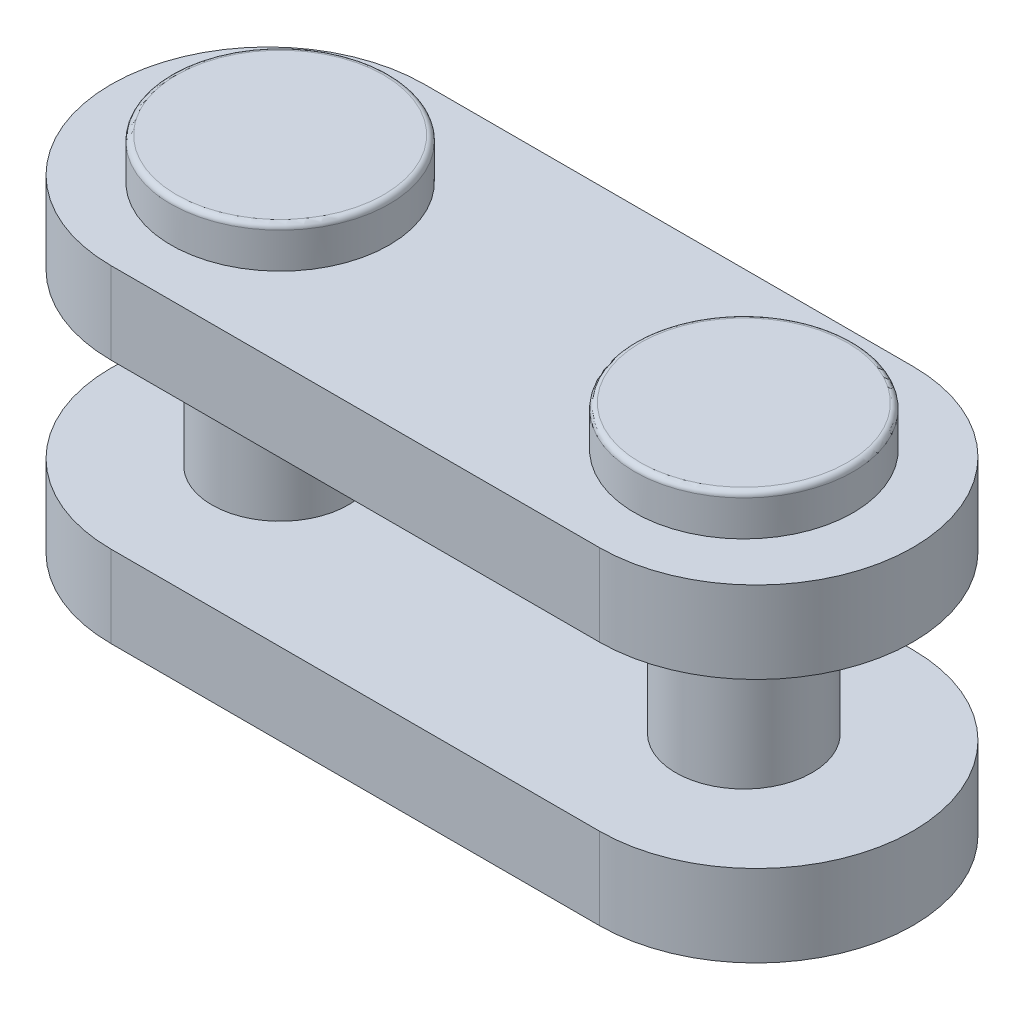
ISO-10303-21;
HEADER;
FILE_DESCRIPTION(('STEP AP214'),'2;1');
FILE_NAME('part.step','',(''),(''),'','','');
FILE_SCHEMA(('AUTOMOTIVE_DESIGN { 1 0 10303 214 1 1 1 1 }'));
ENDSEC;
DATA;
#1=APPLICATION_CONTEXT('core data for automotive mechanical design processes');
#2=APPLICATION_PROTOCOL_DEFINITION('international standard','automotive_design',2000,#1);
#3=PRODUCT_CONTEXT('',#1,'mechanical');
#4=PRODUCT('Part','Part','',(#3));
#5=PRODUCT_RELATED_PRODUCT_CATEGORY('part','',(#4));
#6=PRODUCT_DEFINITION_FORMATION('','',#4);
#7=PRODUCT_DEFINITION_CONTEXT('part definition',#1,'design');
#8=PRODUCT_DEFINITION('design','',#6,#7);
#9=PRODUCT_DEFINITION_SHAPE('','',#8);
#10=(LENGTH_UNIT() NAMED_UNIT(*) SI_UNIT(.MILLI.,.METRE.));
#11=(NAMED_UNIT(*) PLANE_ANGLE_UNIT() SI_UNIT($,.RADIAN.));
#12=(NAMED_UNIT(*) SI_UNIT($,.STERADIAN.) SOLID_ANGLE_UNIT());
#13=UNCERTAINTY_MEASURE_WITH_UNIT(LENGTH_MEASURE(1.E-05),#10,'distance_accuracy_value','');
#14=(GEOMETRIC_REPRESENTATION_CONTEXT(3) GLOBAL_UNCERTAINTY_ASSIGNED_CONTEXT((#13)) GLOBAL_UNIT_ASSIGNED_CONTEXT((#10,
#11,#12)) REPRESENTATION_CONTEXT('',''));
#15=CARTESIAN_POINT('',(0.,0.,0.));
#16=DIRECTION('',(0.,0.,1.));
#17=DIRECTION('',(1.,0.,0.));
#18=AXIS2_PLACEMENT_3D('',#15,#16,#17);
#19=CARTESIAN_POINT('',(0.,6.,0.));
#20=DIRECTION('',(0.,-1.,0.));
#21=DIRECTION('',(0.16756277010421,0.,-0.985861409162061));
#22=AXIS2_PLACEMENT_3D('',#19,#20,#21);
#23=CYLINDRICAL_SURFACE('',#22,2.5);
#24=CARTESIAN_POINT('',(0.,-3.,0.));
#25=DIRECTION('',(0.,1.,0.));
#26=DIRECTION('',(-0.833452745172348,0.,0.552590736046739));
#27=AXIS2_PLACEMENT_3D('',#24,#25,#26);
#28=CIRCLE('',#27,2.5);
#29=CARTESIAN_POINT('',(-2.08363186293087,-3.,1.38147684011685));
#30=VERTEX_POINT('',#29);
#31=EDGE_CURVE('E516',#30,#30,#28,.F.);
#32=ORIENTED_EDGE('',*,*,#31,.F.);
#33=EDGE_LOOP('',(#32));
#34=FACE_BOUND('',#33,.T.);
#35=CARTESIAN_POINT('',(0.,3.,0.));
#36=DIRECTION('',(0.,1.,0.));
#37=DIRECTION('',(-0.833452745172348,0.,0.552590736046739));
#38=AXIS2_PLACEMENT_3D('',#35,#36,#37);
#39=CIRCLE('',#38,2.5);
#40=CARTESIAN_POINT('',(-2.08363186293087,3.,1.38147684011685));
#41=VERTEX_POINT('',#40);
#42=EDGE_CURVE('E141',#41,#41,#39,.F.);
#43=ORIENTED_EDGE('',*,*,#42,.T.);
#44=EDGE_LOOP('',(#43));
#45=FACE_BOUND('',#44,.T.);
#46=ADVANCED_FACE('F14',(#34,#45),#23,.T.);
#47=CARTESIAN_POINT('',(0.,-7.3,0.));
#48=DIRECTION('',(0.,1.,0.));
#49=DIRECTION('',(-0.16756277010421,0.,0.985861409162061));
#50=AXIS2_PLACEMENT_3D('',#47,#48,#49);
#51=TOROIDAL_SURFACE('',#50,3.8,0.2);
#52=CARTESIAN_POINT('',(0.,-7.3,0.));
#53=DIRECTION('',(0.,1.,0.));
#54=DIRECTION('',(-0.16756277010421,0.,0.985861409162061));
#55=AXIS2_PLACEMENT_3D('',#52,#53,#54);
#56=CIRCLE('',#55,4.);
#57=CARTESIAN_POINT('',(-0.670251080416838,-7.3,3.94344563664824));
#58=VERTEX_POINT('',#57);
#59=EDGE_CURVE('E493',#58,#58,#56,.T.);
#60=ORIENTED_EDGE('',*,*,#59,.F.);
#61=EDGE_LOOP('',(#60));
#62=FACE_BOUND('',#61,.T.);
#63=CARTESIAN_POINT('',(0.,-7.5,0.));
#64=DIRECTION('',(0.,-1.,0.));
#65=DIRECTION('',(-0.16756277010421,0.,0.985861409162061));
#66=AXIS2_PLACEMENT_3D('',#63,#64,#65);
#67=CIRCLE('',#66,3.8);
#68=CARTESIAN_POINT('',(-0.636738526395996,-7.5,3.74627335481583));
#69=VERTEX_POINT('',#68);
#70=EDGE_CURVE('E494',#69,#69,#67,.T.);
#71=ORIENTED_EDGE('',*,*,#70,.F.);
#72=EDGE_LOOP('',(#71));
#73=FACE_BOUND('',#72,.T.);
#74=ADVANCED_FACE('F465',(#62,#73),#51,.T.);
#75=CARTESIAN_POINT('',(0.,-6.,0.));
#76=DIRECTION('',(0.,-1.,0.));
#77=DIRECTION('',(0.16756277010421,0.,-0.985861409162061));
#78=AXIS2_PLACEMENT_3D('',#75,#76,#77);
#79=CYLINDRICAL_SURFACE('',#78,4.);
#80=ORIENTED_EDGE('',*,*,#59,.T.);
#81=EDGE_LOOP('',(#80));
#82=FACE_BOUND('',#81,.T.);
#83=CARTESIAN_POINT('',(0.,-6.,0.));
#84=DIRECTION('',(0.,1.,0.));
#85=DIRECTION('',(-0.16756277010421,0.,0.985861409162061));
#86=AXIS2_PLACEMENT_3D('',#83,#84,#85);
#87=CIRCLE('',#86,4.);
#88=CARTESIAN_POINT('',(-0.670251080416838,-6.,3.94344563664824));
#89=VERTEX_POINT('',#88);
#90=EDGE_CURVE('E488',#89,#89,#87,.T.);
#91=ORIENTED_EDGE('',*,*,#90,.F.);
#92=EDGE_LOOP('',(#91));
#93=FACE_BOUND('',#92,.T.);
#94=ADVANCED_FACE('F171',(#82,#93),#79,.T.);
#95=CARTESIAN_POINT('',(0.,-7.5,0.));
#96=DIRECTION('',(0.,1.,0.));
#97=DIRECTION('',(-0.16756277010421,0.,0.985861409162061));
#98=AXIS2_PLACEMENT_3D('',#95,#96,#97);
#99=PLANE('',#98);
#100=ORIENTED_EDGE('',*,*,#70,.T.);
#101=EDGE_LOOP('',(#100));
#102=FACE_BOUND('',#101,.T.);
#103=ADVANCED_FACE('F161',(#102),#99,.F.);
#104=CARTESIAN_POINT('',(16.9999999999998,-7.5,-5.13478148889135E-13));
#105=DIRECTION('',(0.,1.,0.));
#106=DIRECTION('',(-0.0702895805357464,0.,-0.99752662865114));
#107=AXIS2_PLACEMENT_3D('',#104,#105,#106);
#108=PLANE('',#107);
#109=CARTESIAN_POINT('',(16.9999999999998,-7.5,-5.13478148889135E-13));
#110=DIRECTION('',(0.,-1.,0.));
#111=DIRECTION('',(-0.0702895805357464,0.,-0.99752662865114));
#112=AXIS2_PLACEMENT_3D('',#109,#110,#111);
#113=CIRCLE('',#112,3.8);
#114=CARTESIAN_POINT('',(16.7328995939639,-7.5,-3.79060118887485));
#115=VERTEX_POINT('',#114);
#116=EDGE_CURVE('E274',#115,#115,#113,.T.);
#117=ORIENTED_EDGE('',*,*,#116,.T.);
#118=EDGE_LOOP('',(#117));
#119=FACE_BOUND('',#118,.T.);
#120=ADVANCED_FACE('F158',(#119),#108,.F.);
#121=CARTESIAN_POINT('',(16.9999999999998,-7.3,-5.13478148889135E-13));
#122=DIRECTION('',(0.,1.,0.));
#123=DIRECTION('',(-0.0702895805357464,0.,-0.99752662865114));
#124=AXIS2_PLACEMENT_3D('',#121,#122,#123);
#125=TOROIDAL_SURFACE('',#124,3.8,0.2);
#126=CARTESIAN_POINT('',(16.9999999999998,-7.3,-5.13478148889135E-13));
#127=DIRECTION('',(0.,1.,0.));
#128=DIRECTION('',(-0.0702895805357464,0.,-0.99752662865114));
#129=AXIS2_PLACEMENT_3D('',#126,#127,#128);
#130=CIRCLE('',#129,4.);
#131=CARTESIAN_POINT('',(16.7188416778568,-7.3,-3.99010651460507));
#132=VERTEX_POINT('',#131);
#133=EDGE_CURVE('E383',#132,#132,#130,.T.);
#134=ORIENTED_EDGE('',*,*,#133,.F.);
#135=EDGE_LOOP('',(#134));
#136=FACE_BOUND('',#135,.T.);
#137=ORIENTED_EDGE('',*,*,#116,.F.);
#138=EDGE_LOOP('',(#137));
#139=FACE_BOUND('',#138,.T.);
#140=ADVANCED_FACE('F160',(#136,#139),#125,.T.);
#141=CARTESIAN_POINT('',(16.9999999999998,6.,-5.13478148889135E-13));
#142=DIRECTION('',(0.,-1.,0.));
#143=DIRECTION('',(0.0702895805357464,0.,0.99752662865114));
#144=AXIS2_PLACEMENT_3D('',#141,#142,#143);
#145=CYLINDRICAL_SURFACE('',#144,2.5);
#146=CARTESIAN_POINT('',(16.9999999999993,-3.,-2.32886626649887E-13));
#147=DIRECTION('',(0.,1.,0.));
#148=DIRECTION('',(1.,0.,0.));
#149=AXIS2_PLACEMENT_3D('',#146,#147,#148);
#150=CIRCLE('',#149,2.5);
#151=CARTESIAN_POINT('',(19.4999999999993,-3.,-2.36078517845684E-13));
#152=VERTEX_POINT('',#151);
#153=EDGE_CURVE('E256',#152,#152,#150,.T.);
#154=ORIENTED_EDGE('',*,*,#153,.T.);
#155=EDGE_LOOP('',(#154));
#156=FACE_BOUND('',#155,.T.);
#157=CARTESIAN_POINT('',(16.9999999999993,3.,-2.32886626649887E-13));
#158=DIRECTION('',(0.,1.,0.));
#159=DIRECTION('',(1.,0.,0.));
#160=AXIS2_PLACEMENT_3D('',#157,#158,#159);
#161=CIRCLE('',#160,2.5);
#162=CARTESIAN_POINT('',(19.4999999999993,3.,-2.3260907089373E-13));
#163=VERTEX_POINT('',#162);
#164=EDGE_CURVE('E293',#163,#163,#161,.F.);
#165=ORIENTED_EDGE('',*,*,#164,.T.);
#166=EDGE_LOOP('',(#165));
#167=FACE_BOUND('',#166,.T.);
#168=ADVANCED_FACE('F168',(#156,#167),#145,.T.);
#169=CARTESIAN_POINT('',(-0.450000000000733,-3.,-5.75000000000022));
#170=DIRECTION('',(0.,0.,1.));
#171=DIRECTION('',(-1.,0.,0.));
#172=AXIS2_PLACEMENT_3D('',#169,#170,#171);
#173=PLANE('',#172);
#174=DIRECTION('',(-1.,0.,0.));
#175=VECTOR('',#174,1.);
#176=CARTESIAN_POINT('',(-0.450000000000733,-6.,-5.75000000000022));
#177=LINE('',#176,#175);
#178=CARTESIAN_POINT('',(17.4499999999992,-6.,-5.75000000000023));
#179=VERTEX_POINT('',#178);
#180=CARTESIAN_POINT('',(-0.450000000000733,-6.,-5.75000000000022));
#181=VERTEX_POINT('',#180);
#182=EDGE_CURVE('E262',#179,#181,#177,.T.);
#183=ORIENTED_EDGE('',*,*,#182,.T.);
#184=DIRECTION('',(0.,-1.,0.));
#185=VECTOR('',#184,1.);
#186=CARTESIAN_POINT('',(-0.450000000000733,-3.,-5.75000000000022));
#187=LINE('',#186,#185);
#188=CARTESIAN_POINT('',(-0.450000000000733,-3.,-5.75000000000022));
#189=VERTEX_POINT('',#188);
#190=EDGE_CURVE('E261',#189,#181,#187,.T.);
#191=ORIENTED_EDGE('',*,*,#190,.F.);
#192=DIRECTION('',(-1.,0.,0.));
#193=VECTOR('',#192,1.);
#194=CARTESIAN_POINT('',(-0.450000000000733,-3.,-5.75000000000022));
#195=LINE('',#194,#193);
#196=CARTESIAN_POINT('',(17.4499999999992,-3.,-5.75000000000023));
#197=VERTEX_POINT('',#196);
#198=EDGE_CURVE('E240',#197,#189,#195,.T.);
#199=ORIENTED_EDGE('',*,*,#198,.F.);
#200=DIRECTION('',(0.,-1.,0.));
#201=VECTOR('',#200,1.);
#202=CARTESIAN_POINT('',(17.4499999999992,-3.,-5.75000000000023));
#203=LINE('',#202,#201);
#204=EDGE_CURVE('E266',#197,#179,#203,.T.);
#205=ORIENTED_EDGE('',*,*,#204,.T.);
#206=EDGE_LOOP('',(#183,#191,#199,#205));
#207=FACE_BOUND('',#206,.T.);
#208=ADVANCED_FACE('F186',(#207),#173,.F.);
#209=CARTESIAN_POINT('',(17.4499999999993,-3.,-2.33320307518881E-13));
#210=DIRECTION('',(0.,-1.,0.));
#211=DIRECTION('',(-1.,0.,0.));
#212=AXIS2_PLACEMENT_3D('',#209,#210,#211);
#213=CYLINDRICAL_SURFACE('',#212,5.75);
#214=CARTESIAN_POINT('',(17.4499999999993,-6.,-2.33320307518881E-13));
#215=DIRECTION('',(0.,1.,0.));
#216=DIRECTION('',(1.,0.,0.));
#217=AXIS2_PLACEMENT_3D('',#214,#215,#216);
#218=CIRCLE('',#217,5.75);
#219=CARTESIAN_POINT('',(17.4499999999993,-6.,5.74999999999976));
#220=VERTEX_POINT('',#219);
#221=EDGE_CURVE('E278',#220,#179,#218,.T.);
#222=ORIENTED_EDGE('',*,*,#221,.T.);
#223=ORIENTED_EDGE('',*,*,#204,.F.);
#224=CARTESIAN_POINT('',(17.4499999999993,-3.,-2.33320307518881E-13));
#225=DIRECTION('',(0.,1.,0.));
#226=DIRECTION('',(1.,0.,0.));
#227=AXIS2_PLACEMENT_3D('',#224,#225,#226);
#228=CIRCLE('',#227,5.75);
#229=CARTESIAN_POINT('',(17.4499999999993,-3.,5.74999999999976));
#230=VERTEX_POINT('',#229);
#231=EDGE_CURVE('E245',#230,#197,#228,.T.);
#232=ORIENTED_EDGE('',*,*,#231,.F.);
#233=DIRECTION('',(0.,-1.,0.));
#234=VECTOR('',#233,1.);
#235=CARTESIAN_POINT('',(17.4499999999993,-3.,5.74999999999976));
#236=LINE('',#235,#234);
#237=EDGE_CURVE('E265',#230,#220,#236,.T.);
#238=ORIENTED_EDGE('',*,*,#237,.T.);
#239=EDGE_LOOP('',(#222,#223,#232,#238));
#240=FACE_BOUND('',#239,.T.);
#241=ADVANCED_FACE('F197',(#240),#213,.T.);
#242=CARTESIAN_POINT('',(-0.450000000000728,-3.,5.7499999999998));
#243=DIRECTION('',(0.,0.,-1.));
#244=DIRECTION('',(1.,0.,0.));
#245=AXIS2_PLACEMENT_3D('',#242,#243,#244);
#246=PLANE('',#245);
#247=DIRECTION('',(1.,0.,0.));
#248=VECTOR('',#247,1.);
#249=CARTESIAN_POINT('',(-0.450000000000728,-6.,5.7499999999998));
#250=LINE('',#249,#248);
#251=CARTESIAN_POINT('',(-0.450000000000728,-6.,5.7499999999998));
#252=VERTEX_POINT('',#251);
#253=EDGE_CURVE('E258',#252,#220,#250,.T.);
#254=ORIENTED_EDGE('',*,*,#253,.T.);
#255=ORIENTED_EDGE('',*,*,#237,.F.);
#256=DIRECTION('',(1.,0.,0.));
#257=VECTOR('',#256,1.);
#258=CARTESIAN_POINT('',(-0.450000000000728,-3.,5.7499999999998));
#259=LINE('',#258,#257);
#260=CARTESIAN_POINT('',(-0.450000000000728,-3.,5.7499999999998));
#261=VERTEX_POINT('',#260);
#262=EDGE_CURVE('E252',#261,#230,#259,.T.);
#263=ORIENTED_EDGE('',*,*,#262,.F.);
#264=DIRECTION('',(0.,-1.,0.));
#265=VECTOR('',#264,1.);
#266=CARTESIAN_POINT('',(-0.450000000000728,-3.,5.7499999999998));
#267=LINE('',#266,#265);
#268=EDGE_CURVE('E37',#261,#252,#267,.T.);
#269=ORIENTED_EDGE('',*,*,#268,.T.);
#270=EDGE_LOOP('',(#254,#255,#263,#269));
#271=FACE_BOUND('',#270,.T.);
#272=ADVANCED_FACE('F194',(#271),#246,.F.);
#273=CARTESIAN_POINT('',(-0.450000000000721,-3.,-2.14238349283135E-13));
#274=DIRECTION('',(0.,-1.,0.));
#275=DIRECTION('',(-1.,0.,0.));
#276=AXIS2_PLACEMENT_3D('',#273,#274,#275);
#277=CYLINDRICAL_SURFACE('',#276,5.75);
#278=ORIENTED_EDGE('',*,*,#268,.F.);
#279=CARTESIAN_POINT('',(-0.450000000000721,-3.,-2.14238349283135E-13));
#280=DIRECTION('',(0.,1.,0.));
#281=DIRECTION('',(1.,0.,0.));
#282=AXIS2_PLACEMENT_3D('',#279,#280,#281);
#283=CIRCLE('',#282,5.75);
#284=EDGE_CURVE('E268',#189,#261,#283,.T.);
#285=ORIENTED_EDGE('',*,*,#284,.F.);
#286=ORIENTED_EDGE('',*,*,#190,.T.);
#287=CARTESIAN_POINT('',(-0.450000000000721,-6.,-2.14238349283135E-13));
#288=DIRECTION('',(0.,1.,0.));
#289=DIRECTION('',(1.,0.,0.));
#290=AXIS2_PLACEMENT_3D('',#287,#288,#289);
#291=CIRCLE('',#290,5.75);
#292=EDGE_CURVE('E271',#181,#252,#291,.T.);
#293=ORIENTED_EDGE('',*,*,#292,.T.);
#294=EDGE_LOOP('',(#278,#285,#286,#293));
#295=FACE_BOUND('',#294,.T.);
#296=ADVANCED_FACE('F192',(#295),#277,.T.);
#297=CARTESIAN_POINT('',(-0.450000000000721,-3.,-2.14238349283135E-13));
#298=DIRECTION('',(0.,1.,0.));
#299=DIRECTION('',(1.,0.,0.));
#300=AXIS2_PLACEMENT_3D('',#297,#298,#299);
#301=PLANE('',#300);
#302=ORIENTED_EDGE('',*,*,#284,.T.);
#303=ORIENTED_EDGE('',*,*,#262,.T.);
#304=ORIENTED_EDGE('',*,*,#231,.T.);
#305=ORIENTED_EDGE('',*,*,#198,.T.);
#306=EDGE_LOOP('',(#302,#303,#304,#305));
#307=FACE_BOUND('',#306,.T.);
#308=ORIENTED_EDGE('',*,*,#31,.T.);
#309=EDGE_LOOP('',(#308));
#310=FACE_BOUND('',#309,.T.);
#311=ORIENTED_EDGE('',*,*,#153,.F.);
#312=EDGE_LOOP('',(#311));
#313=FACE_BOUND('',#312,.T.);
#314=ADVANCED_FACE('F188',(#307,#310,#313),#301,.T.);
#315=CARTESIAN_POINT('',(-0.450000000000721,6.,-5.75000000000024));
#316=DIRECTION('',(0.,0.,1.));
#317=DIRECTION('',(-1.,0.,0.));
#318=AXIS2_PLACEMENT_3D('',#315,#316,#317);
#319=PLANE('',#318);
#320=DIRECTION('',(-1.,0.,0.));
#321=VECTOR('',#320,1.);
#322=CARTESIAN_POINT('',(-0.450000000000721,3.,-5.75000000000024));
#323=LINE('',#322,#321);
#324=CARTESIAN_POINT('',(17.4499999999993,3.,-5.75000000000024));
#325=VERTEX_POINT('',#324);
#326=CARTESIAN_POINT('',(-0.450000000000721,3.,-5.75000000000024));
#327=VERTEX_POINT('',#326);
#328=EDGE_CURVE('E135',#325,#327,#323,.T.);
#329=ORIENTED_EDGE('',*,*,#328,.T.);
#330=DIRECTION('',(0.,-1.,0.));
#331=VECTOR('',#330,1.);
#332=CARTESIAN_POINT('',(-0.450000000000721,6.,-5.75000000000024));
#333=LINE('',#332,#331);
#334=CARTESIAN_POINT('',(-0.450000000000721,6.,-5.75000000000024));
#335=VERTEX_POINT('',#334);
#336=EDGE_CURVE('E128',#335,#327,#333,.T.);
#337=ORIENTED_EDGE('',*,*,#336,.F.);
#338=DIRECTION('',(-1.,0.,0.));
#339=VECTOR('',#338,1.);
#340=CARTESIAN_POINT('',(-0.450000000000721,6.,-5.75000000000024));
#341=LINE('',#340,#339);
#342=CARTESIAN_POINT('',(17.4499999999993,6.,-5.75000000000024));
#343=VERTEX_POINT('',#342);
#344=EDGE_CURVE('E99',#343,#335,#341,.T.);
#345=ORIENTED_EDGE('',*,*,#344,.F.);
#346=DIRECTION('',(0.,-1.,0.));
#347=VECTOR('',#346,1.);
#348=CARTESIAN_POINT('',(17.4499999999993,6.,-5.75000000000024));
#349=LINE('',#348,#347);
#350=EDGE_CURVE('E101',#343,#325,#349,.T.);
#351=ORIENTED_EDGE('',*,*,#350,.T.);
#352=EDGE_LOOP('',(#329,#337,#345,#351));
#353=FACE_BOUND('',#352,.T.);
#354=ADVANCED_FACE('F191',(#353),#319,.F.);
#355=CARTESIAN_POINT('',(17.4499999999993,6.,-2.33320307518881E-13));
#356=DIRECTION('',(0.,-1.,0.));
#357=DIRECTION('',(-1.,0.,0.));
#358=AXIS2_PLACEMENT_3D('',#355,#356,#357);
#359=CYLINDRICAL_SURFACE('',#358,5.75);
#360=CARTESIAN_POINT('',(17.4499999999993,3.,-2.33320307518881E-13));
#361=DIRECTION('',(0.,1.,0.));
#362=DIRECTION('',(1.,0.,0.));
#363=AXIS2_PLACEMENT_3D('',#360,#361,#362);
#364=CIRCLE('',#363,5.75);
#365=CARTESIAN_POINT('',(17.4499999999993,3.,5.74999999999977));
#366=VERTEX_POINT('',#365);
#367=EDGE_CURVE('E112',#366,#325,#364,.T.);
#368=ORIENTED_EDGE('',*,*,#367,.T.);
#369=ORIENTED_EDGE('',*,*,#350,.F.);
#370=CARTESIAN_POINT('',(17.4499999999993,6.,-2.33320307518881E-13));
#371=DIRECTION('',(0.,1.,0.));
#372=DIRECTION('',(1.,0.,0.));
#373=AXIS2_PLACEMENT_3D('',#370,#371,#372);
#374=CIRCLE('',#373,5.75);
#375=CARTESIAN_POINT('',(17.4499999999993,6.,5.74999999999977));
#376=VERTEX_POINT('',#375);
#377=EDGE_CURVE('E118',#376,#343,#374,.T.);
#378=ORIENTED_EDGE('',*,*,#377,.F.);
#379=DIRECTION('',(0.,-1.,0.));
#380=VECTOR('',#379,1.);
#381=CARTESIAN_POINT('',(17.4499999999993,6.,5.74999999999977));
#382=LINE('',#381,#380);
#383=EDGE_CURVE('E115',#376,#366,#382,.T.);
#384=ORIENTED_EDGE('',*,*,#383,.T.);
#385=EDGE_LOOP('',(#368,#369,#378,#384));
#386=FACE_BOUND('',#385,.T.);
#387=ADVANCED_FACE('F215',(#386),#359,.T.);
#388=CARTESIAN_POINT('',(-0.450000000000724,6.,5.74999999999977));
#389=DIRECTION('',(0.,0.,-1.));
#390=DIRECTION('',(1.,0.,0.));
#391=AXIS2_PLACEMENT_3D('',#388,#389,#390);
#392=PLANE('',#391);
#393=DIRECTION('',(1.,0.,0.));
#394=VECTOR('',#393,1.);
#395=CARTESIAN_POINT('',(-0.450000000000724,3.,5.74999999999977));
#396=LINE('',#395,#394);
#397=CARTESIAN_POINT('',(-0.450000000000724,3.,5.74999999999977));
#398=VERTEX_POINT('',#397);
#399=EDGE_CURVE('E111',#398,#366,#396,.T.);
#400=ORIENTED_EDGE('',*,*,#399,.T.);
#401=ORIENTED_EDGE('',*,*,#383,.F.);
#402=DIRECTION('',(1.,0.,0.));
#403=VECTOR('',#402,1.);
#404=CARTESIAN_POINT('',(-0.450000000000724,6.,5.74999999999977));
#405=LINE('',#404,#403);
#406=CARTESIAN_POINT('',(-0.450000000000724,6.,5.74999999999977));
#407=VERTEX_POINT('',#406);
#408=EDGE_CURVE('E96',#407,#376,#405,.T.);
#409=ORIENTED_EDGE('',*,*,#408,.F.);
#410=DIRECTION('',(0.,-1.,0.));
#411=VECTOR('',#410,1.);
#412=CARTESIAN_POINT('',(-0.450000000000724,6.,5.74999999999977));
#413=LINE('',#412,#411);
#414=EDGE_CURVE('E104',#407,#398,#413,.T.);
#415=ORIENTED_EDGE('',*,*,#414,.T.);
#416=EDGE_LOOP('',(#400,#401,#409,#415));
#417=FACE_BOUND('',#416,.T.);
#418=ADVANCED_FACE('F114',(#417),#392,.F.);
#419=CARTESIAN_POINT('',(-0.450000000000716,6.,-2.42861286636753E-13));
#420=DIRECTION('',(0.,-1.,0.));
#421=DIRECTION('',(-1.,0.,0.));
#422=AXIS2_PLACEMENT_3D('',#419,#420,#421);
#423=CYLINDRICAL_SURFACE('',#422,5.75);
#424=ORIENTED_EDGE('',*,*,#414,.F.);
#425=CARTESIAN_POINT('',(-0.450000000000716,6.,-2.42861286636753E-13));
#426=DIRECTION('',(0.,1.,0.));
#427=DIRECTION('',(1.,0.,0.));
#428=AXIS2_PLACEMENT_3D('',#425,#426,#427);
#429=CIRCLE('',#428,5.75);
#430=EDGE_CURVE('E87',#335,#407,#429,.T.);
#431=ORIENTED_EDGE('',*,*,#430,.F.);
#432=ORIENTED_EDGE('',*,*,#336,.T.);
#433=CARTESIAN_POINT('',(-0.450000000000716,3.,-2.42861286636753E-13));
#434=DIRECTION('',(0.,1.,0.));
#435=DIRECTION('',(1.,0.,0.));
#436=AXIS2_PLACEMENT_3D('',#433,#434,#435);
#437=CIRCLE('',#436,5.75);
#438=EDGE_CURVE('E106',#327,#398,#437,.T.);
#439=ORIENTED_EDGE('',*,*,#438,.T.);
#440=EDGE_LOOP('',(#424,#431,#432,#439));
#441=FACE_BOUND('',#440,.T.);
#442=ADVANCED_FACE('F105',(#441),#423,.T.);
#443=CARTESIAN_POINT('',(-0.450000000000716,6.,-2.42861286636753E-13));
#444=DIRECTION('',(0.,1.,0.));
#445=DIRECTION('',(1.,0.,0.));
#446=AXIS2_PLACEMENT_3D('',#443,#444,#445);
#447=PLANE('',#446);
#448=CARTESIAN_POINT('',(16.9999999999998,6.,-5.13478148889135E-13));
#449=DIRECTION('',(0.,1.,0.));
#450=DIRECTION('',(-0.0702895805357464,0.,-0.99752662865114));
#451=AXIS2_PLACEMENT_3D('',#448,#449,#450);
#452=CIRCLE('',#451,4.);
#453=CARTESIAN_POINT('',(16.7188416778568,6.,-3.99010651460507));
#454=VERTEX_POINT('',#453);
#455=EDGE_CURVE('E295',#454,#454,#452,.T.);
#456=ORIENTED_EDGE('',*,*,#455,.F.);
#457=EDGE_LOOP('',(#456));
#458=FACE_BOUND('',#457,.T.);
#459=ORIENTED_EDGE('',*,*,#430,.T.);
#460=ORIENTED_EDGE('',*,*,#408,.T.);
#461=ORIENTED_EDGE('',*,*,#377,.T.);
#462=ORIENTED_EDGE('',*,*,#344,.T.);
#463=EDGE_LOOP('',(#459,#460,#461,#462));
#464=FACE_BOUND('',#463,.T.);
#465=CARTESIAN_POINT('',(0.,6.,0.));
#466=DIRECTION('',(0.,1.,0.));
#467=DIRECTION('',(-0.16756277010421,0.,0.985861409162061));
#468=AXIS2_PLACEMENT_3D('',#465,#466,#467);
#469=CIRCLE('',#468,4.);
#470=CARTESIAN_POINT('',(-0.670251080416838,6.,3.94344563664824));
#471=VERTEX_POINT('',#470);
#472=EDGE_CURVE('E509',#471,#471,#469,.T.);
#473=ORIENTED_EDGE('',*,*,#472,.F.);
#474=EDGE_LOOP('',(#473));
#475=FACE_BOUND('',#474,.T.);
#476=ADVANCED_FACE('F93',(#458,#464,#475),#447,.T.);
#477=CARTESIAN_POINT('',(-0.450000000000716,3.,-2.42861286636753E-13));
#478=DIRECTION('',(0.,1.,0.));
#479=DIRECTION('',(1.,0.,0.));
#480=AXIS2_PLACEMENT_3D('',#477,#478,#479);
#481=PLANE('',#480);
#482=ORIENTED_EDGE('',*,*,#438,.F.);
#483=ORIENTED_EDGE('',*,*,#328,.F.);
#484=ORIENTED_EDGE('',*,*,#367,.F.);
#485=ORIENTED_EDGE('',*,*,#399,.F.);
#486=EDGE_LOOP('',(#482,#483,#484,#485));
#487=FACE_BOUND('',#486,.T.);
#488=ORIENTED_EDGE('',*,*,#42,.F.);
#489=EDGE_LOOP('',(#488));
#490=FACE_BOUND('',#489,.T.);
#491=ORIENTED_EDGE('',*,*,#164,.F.);
#492=EDGE_LOOP('',(#491));
#493=FACE_BOUND('',#492,.T.);
#494=ADVANCED_FACE('F181',(#487,#490,#493),#481,.F.);
#495=CARTESIAN_POINT('',(16.9999999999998,-6.,-5.13478148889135E-13));
#496=DIRECTION('',(0.,-1.,0.));
#497=DIRECTION('',(0.0702895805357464,0.,0.99752662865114));
#498=AXIS2_PLACEMENT_3D('',#495,#496,#497);
#499=CYLINDRICAL_SURFACE('',#498,4.);
#500=ORIENTED_EDGE('',*,*,#133,.T.);
#501=EDGE_LOOP('',(#500));
#502=FACE_BOUND('',#501,.T.);
#503=CARTESIAN_POINT('',(16.9999999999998,-6.,-5.13478148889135E-13));
#504=DIRECTION('',(0.,1.,0.));
#505=DIRECTION('',(-0.0702895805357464,0.,-0.99752662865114));
#506=AXIS2_PLACEMENT_3D('',#503,#504,#505);
#507=CIRCLE('',#506,4.);
#508=CARTESIAN_POINT('',(16.7188416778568,-6.,-3.99010651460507));
#509=VERTEX_POINT('',#508);
#510=EDGE_CURVE('E375',#509,#509,#507,.T.);
#511=ORIENTED_EDGE('',*,*,#510,.F.);
#512=EDGE_LOOP('',(#511));
#513=FACE_BOUND('',#512,.T.);
#514=ADVANCED_FACE('F178',(#502,#513),#499,.T.);
#515=CARTESIAN_POINT('',(-0.450000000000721,-6.,-2.14238349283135E-13));
#516=DIRECTION('',(0.,1.,0.));
#517=DIRECTION('',(1.,0.,0.));
#518=AXIS2_PLACEMENT_3D('',#515,#516,#517);
#519=PLANE('',#518);
#520=ORIENTED_EDGE('',*,*,#510,.T.);
#521=EDGE_LOOP('',(#520));
#522=FACE_BOUND('',#521,.T.);
#523=ORIENTED_EDGE('',*,*,#292,.F.);
#524=ORIENTED_EDGE('',*,*,#182,.F.);
#525=ORIENTED_EDGE('',*,*,#221,.F.);
#526=ORIENTED_EDGE('',*,*,#253,.F.);
#527=EDGE_LOOP('',(#523,#524,#525,#526));
#528=FACE_BOUND('',#527,.T.);
#529=ORIENTED_EDGE('',*,*,#90,.T.);
#530=EDGE_LOOP('',(#529));
#531=FACE_BOUND('',#530,.T.);
#532=ADVANCED_FACE('F180',(#522,#528,#531),#519,.F.);
#533=CARTESIAN_POINT('',(0.,7.5,0.));
#534=DIRECTION('',(0.,1.,0.));
#535=DIRECTION('',(0.,0.,1.));
#536=AXIS2_PLACEMENT_3D('',#533,#534,#535);
#537=PLANE('',#536);
#538=CARTESIAN_POINT('',(0.,7.5,0.));
#539=DIRECTION('',(0.,1.,0.));
#540=DIRECTION('',(0.,0.,1.));
#541=AXIS2_PLACEMENT_3D('',#538,#539,#540);
#542=CIRCLE('',#541,3.8);
#543=CARTESIAN_POINT('',(0.,7.5,3.8));
#544=VERTEX_POINT('',#543);
#545=EDGE_CURVE('E23',#544,#544,#542,.T.);
#546=ORIENTED_EDGE('',*,*,#545,.T.);
#547=EDGE_LOOP('',(#546));
#548=FACE_BOUND('',#547,.T.);
#549=ADVANCED_FACE('F146',(#548),#537,.T.);
#550=CARTESIAN_POINT('',(0.,7.5,0.));
#551=DIRECTION('',(0.,-1.,0.));
#552=DIRECTION('',(0.,0.,-1.));
#553=AXIS2_PLACEMENT_3D('',#550,#551,#552);
#554=CYLINDRICAL_SURFACE('',#553,4.);
#555=CARTESIAN_POINT('',(0.,7.3,0.));
#556=DIRECTION('',(0.,1.,0.));
#557=DIRECTION('',(0.,0.,1.));
#558=AXIS2_PLACEMENT_3D('',#555,#556,#557);
#559=CIRCLE('',#558,4.);
#560=CARTESIAN_POINT('',(0.,7.3,4.));
#561=VERTEX_POINT('',#560);
#562=EDGE_CURVE('E9',#561,#561,#559,.F.);
#563=ORIENTED_EDGE('',*,*,#562,.T.);
#564=EDGE_LOOP('',(#563));
#565=FACE_BOUND('',#564,.T.);
#566=ORIENTED_EDGE('',*,*,#472,.T.);
#567=EDGE_LOOP('',(#566));
#568=FACE_BOUND('',#567,.T.);
#569=ADVANCED_FACE('F697',(#565,#568),#554,.T.);
#570=CARTESIAN_POINT('',(16.9999999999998,7.5,-5.13478148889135E-13));
#571=DIRECTION('',(0.,1.,0.));
#572=DIRECTION('',(0.,0.,1.));
#573=AXIS2_PLACEMENT_3D('',#570,#571,#572);
#574=PLANE('',#573);
#575=CARTESIAN_POINT('',(16.9999999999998,7.5,-5.13478148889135E-13));
#576=DIRECTION('',(0.,1.,0.));
#577=DIRECTION('',(0.,0.,1.));
#578=AXIS2_PLACEMENT_3D('',#575,#576,#577);
#579=CIRCLE('',#578,3.8);
#580=CARTESIAN_POINT('',(16.9999999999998,7.5,3.79999999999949));
#581=VERTEX_POINT('',#580);
#582=EDGE_CURVE('E137',#581,#581,#579,.T.);
#583=ORIENTED_EDGE('',*,*,#582,.T.);
#584=EDGE_LOOP('',(#583));
#585=FACE_BOUND('',#584,.T.);
#586=ADVANCED_FACE('F704',(#585),#574,.T.);
#587=CARTESIAN_POINT('',(16.9999999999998,7.5,-5.13478148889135E-13));
#588=DIRECTION('',(0.,-1.,0.));
#589=DIRECTION('',(0.,0.,-1.));
#590=AXIS2_PLACEMENT_3D('',#587,#588,#589);
#591=CYLINDRICAL_SURFACE('',#590,4.);
#592=CARTESIAN_POINT('',(16.9999999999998,7.3,-5.13478148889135E-13));
#593=DIRECTION('',(0.,1.,0.));
#594=DIRECTION('',(0.,0.,1.));
#595=AXIS2_PLACEMENT_3D('',#592,#593,#594);
#596=CIRCLE('',#595,4.);
#597=CARTESIAN_POINT('',(16.9999999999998,7.3,3.99999999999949));
#598=VERTEX_POINT('',#597);
#599=EDGE_CURVE('E140',#598,#598,#596,.F.);
#600=ORIENTED_EDGE('',*,*,#599,.T.);
#601=EDGE_LOOP('',(#600));
#602=FACE_BOUND('',#601,.T.);
#603=ORIENTED_EDGE('',*,*,#455,.T.);
#604=EDGE_LOOP('',(#603));
#605=FACE_BOUND('',#604,.T.);
#606=ADVANCED_FACE('F155',(#602,#605),#591,.T.);
#607=CARTESIAN_POINT('',(16.9999999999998,7.3,-5.13478148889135E-13));
#608=DIRECTION('',(0.,1.,0.));
#609=DIRECTION('',(0.,0.,1.));
#610=AXIS2_PLACEMENT_3D('',#607,#608,#609);
#611=TOROIDAL_SURFACE('',#610,3.8,0.2);
#612=ORIENTED_EDGE('',*,*,#599,.F.);
#613=EDGE_LOOP('',(#612));
#614=FACE_BOUND('',#613,.T.);
#615=ORIENTED_EDGE('',*,*,#582,.F.);
#616=EDGE_LOOP('',(#615));
#617=FACE_BOUND('',#616,.T.);
#618=ADVANCED_FACE('F149',(#614,#617),#611,.T.);
#619=CARTESIAN_POINT('',(0.,7.3,0.));
#620=DIRECTION('',(0.,1.,0.));
#621=DIRECTION('',(0.,0.,1.));
#622=AXIS2_PLACEMENT_3D('',#619,#620,#621);
#623=TOROIDAL_SURFACE('',#622,3.8,0.2);
#624=ORIENTED_EDGE('',*,*,#562,.F.);
#625=EDGE_LOOP('',(#624));
#626=FACE_BOUND('',#625,.T.);
#627=ORIENTED_EDGE('',*,*,#545,.F.);
#628=EDGE_LOOP('',(#627));
#629=FACE_BOUND('',#628,.T.);
#630=ADVANCED_FACE('F16',(#626,#629),#623,.T.);
#631=CLOSED_SHELL('',(#46,#74,#94,#103,#120,#140,#168,#208,#241,#272,#296,#314,#354,#387,#418,
#442,#476,#494,#514,#532,#549,#569,#586,#606,#618,#630));
#632=MANIFOLD_SOLID_BREP('B1',#631);
#633=ADVANCED_BREP_SHAPE_REPRESENTATION('',(#18,#632),#14);
#634=SHAPE_DEFINITION_REPRESENTATION(#9,#633);
ENDSEC;
END-ISO-10303-21;
